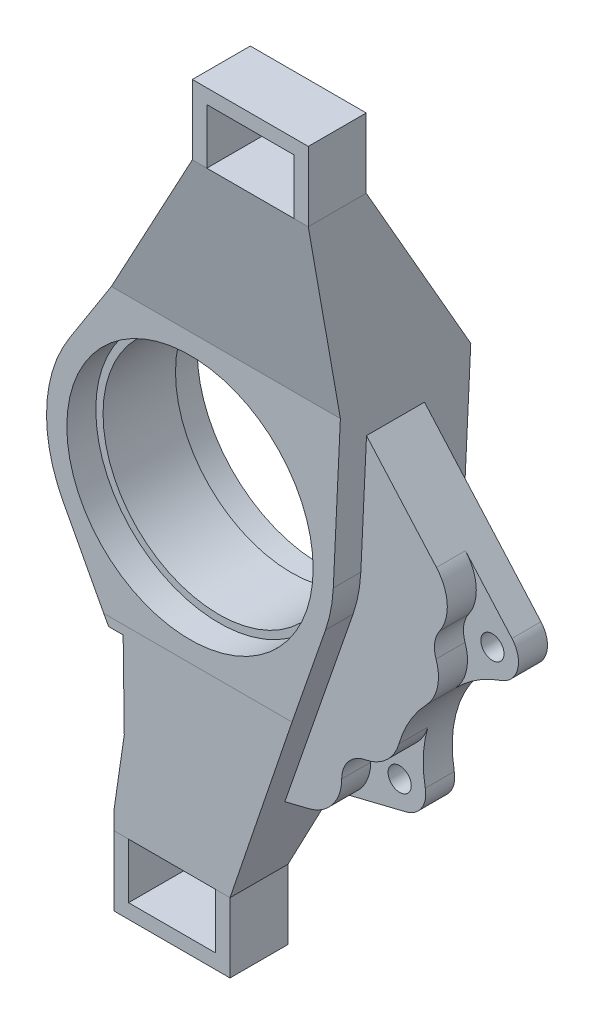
from build123d import *

# Parameters (mm, degrees)
OVERALL_SKETCH_R            = 49.5
OVERALL_SKETCH_R_2          = 42.5
OVERALL_SKETCH_R_3          = 40
CENTER_DEPTH                = 45
SKETCH4_R                   = 42.5
SHAFT_INNER_CUT_1_DEPTH     = 10
SHAFT_START                 = -10
SKETCH5_R                   = 42.5
SHAFT_INNER_CUT_2_DEPTH     = 10
OVERALL_SKETCH_12_R         = 9
OVERALL_SKETCH_12_R_2       = 4
OVERALL_SKETCH_12_W         = 30
OVERALL_SKETCH_12_H         = 19
ARM_EXTRUDE_DEPTH           = 59.1875
MAIN_START                  = -43.729033
MAIN_SIDE_CUT_DEPTH         = 137.578053
MAIN_CALLIPER_CUT_BOT_DEPTH = 15.5
MAIN_START_2                = -9.5
MAIN_CALLIPER_CUT_TOP_DEPTH = 9.5
CALLIPER_START              = -10
CALLIPER_BOLT_CUTS_R        = 4
CALLIPER_BOLT_CUT_TOP_DEPTH = 10
CUT_EXTRUDE11_DEPTH         = 17


with BuildPart() as part:
    # Overall Sketch → Center (new body)
    # profile 1 of 2: a face of its own
    with BuildSketch(Plane.XY):
        with Locations(Location((0, 0, 0), (0, 0, 180))):
            Circle(OVERALL_SKETCH_R)
        Circle(OVERALL_SKETCH_R_2, mode=Mode.SUBTRACT)
    # profile 2 of 2: a face of its own
    with BuildSketch(Plane.XY):
        Circle(OVERALL_SKETCH_R_2)
        with Locations(Location((0, 0, 0), (0, 0, 180))):
            Circle(OVERALL_SKETCH_R_3, mode=Mode.SUBTRACT)
    extrude(amount=CENTER_DEPTH)

    # Sketch4 → Shaft Inner Cut 1 (cut)
    with BuildSketch(Plane.XY.offset(45)):
        Circle(SKETCH4_R)
    extrude(amount=-SHAFT_INNER_CUT_1_DEPTH, mode=Mode.SUBTRACT)

    # Sketch5 → Shaft Inner Cut 2 (cut)
    with BuildSketch(Plane(origin=(0, 0, 0), x_dir=(-1, 0, 0), z_dir=(0, 0, -1)).offset(SHAFT_START)):
        with Locations(Location((0, 0, 0), (0, 0, 180))):
            Circle(SKETCH5_R)
    extrude(amount=SHAFT_INNER_CUT_2_DEPTH, mode=Mode.SUBTRACT)

    # Overall Sketch_12 → Arm Extrude (add)
    # profile 1 of 5: a face of its own
    with BuildSketch(Plane.XY):
        with BuildLine():
            ThreePointArc((49.445085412, -2.330993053), (48.603552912, -9.377880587), (46.762936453, -16.231998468))
            Line((46.762936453, -16.231998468), (23.22900551, -84.031149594))
            Line((23.22900551, -84.031149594), (55.002421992, -76.201397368))
            ThreePointArc((55.002421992, -76.201397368), (45.274740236, -62.601713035), (61.690404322, -65.780577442))
            ThreePointArc((61.690404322, -65.780577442), (66.344431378, -38.303975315), (87.812853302, -20.535168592))
            ThreePointArc((87.812853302, -20.535168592), (76.142364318, -9.758118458), (91.596344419, -6.081214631))
            Line((91.596344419, -6.081214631), (51.414284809, 39.4397159))
            Line((51.414284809, 39.4397159), (49.445085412, -2.330993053))
        make_face()
    # profile 2 of 5: a face of its own
    with BuildSketch(Plane.XY):
        with Locations((84.849019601, -12.037187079)):
            Circle(OVERALL_SKETCH_12_R)
        with Locations((84.849019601, -12.037187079)):
            Circle(OVERALL_SKETCH_12_R_2, mode=Mode.SUBTRACT)
    # profile 3 of 5: a face of its own
    with BuildSketch(Plane.XY):
        with Locations((52.849019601, -67.462812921)):
            Circle(OVERALL_SKETCH_12_R)
        with Locations((52.849019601, -67.462812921)):
            Circle(OVERALL_SKETCH_12_R_2, mode=Mode.SUBTRACT)
    # profile 4 of 5: a face of its own
    with BuildSketch(Plane.XY):
        with BuildLine():
            ThreePointArc((46.762936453, -16.231998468), (3.7977641, -49.354097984), (-43.729033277, -23.195293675))
            Line((-43.729033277, -23.195293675), (-28.1, -52.66))
            Line((-28.1, -52.66), (-23.1, -52.66))
            Line((-23.1, -52.66), (-23.1, -82.66))
            Line((-23.1, -82.66), (-27, -107.5))
            Line((-27, -107.5), (-27, -137.5))
            Line((-27, -137.5), (13, -137.5))
            Line((13, -137.5), (13, -113.5))
            Line((13, -113.5), (23.22900551, -84.031149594))
            Line((23.22900551, -84.031149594), (46.762936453, -16.231998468))
        make_face()
        with Locations((-7, -123)):
            Rectangle(OVERALL_SKETCH_12_W, OVERALL_SKETCH_12_H, mode=Mode.SUBTRACT)
    # profile 5 of 5: a face of its own
    with BuildSketch(Plane.XY):
        with BuildLine():
            Line((15, 115.5), (-41.724462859, 26.633047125))
            ThreePointArc((-41.724462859, 26.633047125), (13.872438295, 47.516370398), (49.5, 0))
            ThreePointArc((49.5, 0), (49.486269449, -1.165819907), (49.445085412, -2.330993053))
            Line((49.445085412, -2.330993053), (51.414284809, 39.4397159))
            Line((51.414284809, 39.4397159), (55, 115.5))
            Line((55, 115.5), (55, 139.5))
            Line((55, 139.5), (15, 139.5))
            Line((15, 139.5), (15, 115.5))
        make_face()
        with Locations((35, 125)):
            Rectangle(OVERALL_SKETCH_12_W, OVERALL_SKETCH_12_H, mode=Mode.SUBTRACT)
    extrude(amount=ARM_EXTRUDE_DEPTH)

    # Arm Cut Sketch → Main Side Cut (cut)
    with BuildSketch(Plane(origin=(0, 0, 0), x_dir=(0, 0, -1), z_dir=(1, 0, 0)).offset(MAIN_START)):
        Polygon((-59.1875, -137.5), (-59.1875, 115.5), (-45, 49.5), (-45, -49.5), (-44.1875, -113.5), (-44.1875, -137.5), align=None)
        Polygon((0, 139.5), (0, 49.5), (-39.1875, 115.5), (-39.1875, 139.5), align=None)
        Polygon((0, -137.5), (-24.1875, -137.5), (-24.1875, -113.5), (0, -49.5), align=None)
    extrude(amount=MAIN_SIDE_CUT_DEPTH, mode=Mode.SUBTRACT)

    # Main Calliper Outline _Bot → Main Calliper Cut _Bot (cut)
    with BuildSketch(Plane.XY):
        with BuildLine():
            Line((51.414284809, 39.4397159), (49.445085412, -2.330993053))
            ThreePointArc((49.445085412, -2.330993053), (48.603552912, -9.377880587), (46.762936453, -16.231998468))
            Line((46.762936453, -16.231998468), (23.22900551, -84.031149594))
            Line((23.22900551, -84.031149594), (55.002421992, -76.201397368))
            ThreePointArc((55.002421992, -76.201397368), (60.423298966, -72.323912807), (61.690404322, -65.780577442))
            ThreePointArc((61.690404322, -65.780577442), (66.344431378, -38.303975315), (87.812853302, -20.535168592))
            ThreePointArc((87.812853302, -20.535168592), (93.555674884, -14.3162557), (91.596344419, -6.081214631))
            Line((91.596344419, -6.081214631), (51.414284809, 39.4397159))
        make_face()
    extrude(amount=MAIN_CALLIPER_CUT_BOT_DEPTH, mode=Mode.SUBTRACT)

    # Main Calliper Outline _Top → Main Calliper Cut _Top (cut)
    with BuildSketch(Plane.XY.offset(45).offset(MAIN_START_2)):
        with BuildLine():
            Line((51.414284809, 39.4397159), (49.445085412, -2.330993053))
            ThreePointArc((49.445085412, -2.330993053), (48.603552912, -9.377880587), (46.762936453, -16.231998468))
            Line((46.762936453, -16.231998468), (23.22900551, -84.031149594))
            Line((23.22900551, -84.031149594), (55.002421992, -76.201397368))
            ThreePointArc((55.002421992, -76.201397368), (60.423298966, -72.323912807), (61.690404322, -65.780577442))
            ThreePointArc((61.690404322, -65.780577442), (66.344431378, -38.303975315), (87.812853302, -20.535168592))
            ThreePointArc((87.812853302, -20.535168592), (93.555674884, -14.3162557), (91.596344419, -6.081214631))
            Line((91.596344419, -6.081214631), (51.414284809, 39.4397159))
        make_face()
    extrude(amount=MAIN_CALLIPER_CUT_TOP_DEPTH, mode=Mode.SUBTRACT)

    # Calliper Bolt Cuts → Calliper Bolt Cut _Top (cut)
    # profile 1 of 2: a face of its own
    with BuildSketch(Plane.XY.offset(35.5).offset(CALLIPER_START)):
        with BuildLine():
            ThreePointArc((42.849022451, -67.455262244), (39.653053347, -76.699472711), (31.438030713, -82.008243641))
            Line((31.438030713, -82.008243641), (55.002421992, -76.201397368))
            ThreePointArc((55.002421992, -76.201397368), (60.423298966, -72.323912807), (61.690404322, -65.780577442))
            ThreePointArc((61.690404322, -65.780577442), (61.031346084, -56.388308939), (62.58597144, -47.102179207))
            ThreePointArc((62.58597144, -47.102179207), (58.270365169, -54.005962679), (50.983878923, -57.638290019))
            ThreePointArc((50.983878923, -57.638290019), (45.149109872, -61.082265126), (42.849022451, -67.455262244))
        make_face()
        with Locations(Location((52.849019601, -67.462812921, 0), (0, 0, 180))):
            Circle(CALLIPER_BOLT_CUTS_R, mode=Mode.SUBTRACT)
    # profile 2 of 2: a face of its own
    with BuildSketch(Plane.XY.offset(35.5).offset(CALLIPER_START)):
        with BuildLine():
            ThreePointArc((75.408162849, -15.334189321), (75.905718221, -23.460635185), (72.084669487, -30.649951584))
            ThreePointArc((72.084669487, -30.649951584), (79.349381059, -24.660541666), (87.812853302, -20.535168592))
            ThreePointArc((87.812853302, -20.535168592), (93.555674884, -14.3162557), (91.596344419, -6.081214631))
            Line((91.596344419, -6.081214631), (75.535520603, 12.113563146))
            ThreePointArc((75.535520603, 12.113563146), (79.263907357, 3.070954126), (76.625403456, -6.347535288))
            ThreePointArc((76.625403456, -6.347535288), (74.939509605, -10.694945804), (75.408162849, -15.334189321))
        make_face()
        with Locations(Location((84.849019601, -12.037187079, 0), (0, 0, 180))):
            Circle(CALLIPER_BOLT_CUTS_R, mode=Mode.SUBTRACT)
    extrude(amount=CALLIPER_BOLT_CUT_TOP_DEPTH, mode=Mode.SUBTRACT)

    # Sketch15 → Cut-Extrude11 (cut)
    with BuildSketch(Plane(origin=(0, 0, 15.5), x_dir=(-1, 0, 0), z_dir=(0, 0, -1))):
        with BuildLine():
            Line((-50.940905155, 29.398374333), (-77.847774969, -1.08353136))
            ThreePointArc((-77.847774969, -1.08353136), (-72.081982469, -9.587133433), (-74.29034624, -19.621013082))
            ThreePointArc((-74.29034624, -19.621013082), (-60.282253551, -34.803975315), (-54.137468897, -54.526820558))
            ThreePointArc((-54.137468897, -54.526820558), (-42.398532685, -59.730586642), (-40.855425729, -72.47815997))
            Line((-40.855425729, -72.47815997), (-25.965556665, -76.147390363))
            Line((-25.965556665, -76.147390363), (-46.762936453, -16.231998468))
            ThreePointArc((-46.762936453, -16.231998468), (-48.603552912, -9.377880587), (-49.445085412, -2.330993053))
            Line((-49.445085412, -2.330993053), (-50.940905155, 29.398374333))
        make_face()
    extrude(amount=-CUT_EXTRUDE11_DEPTH, mode=Mode.SUBTRACT)


solid = part.part
